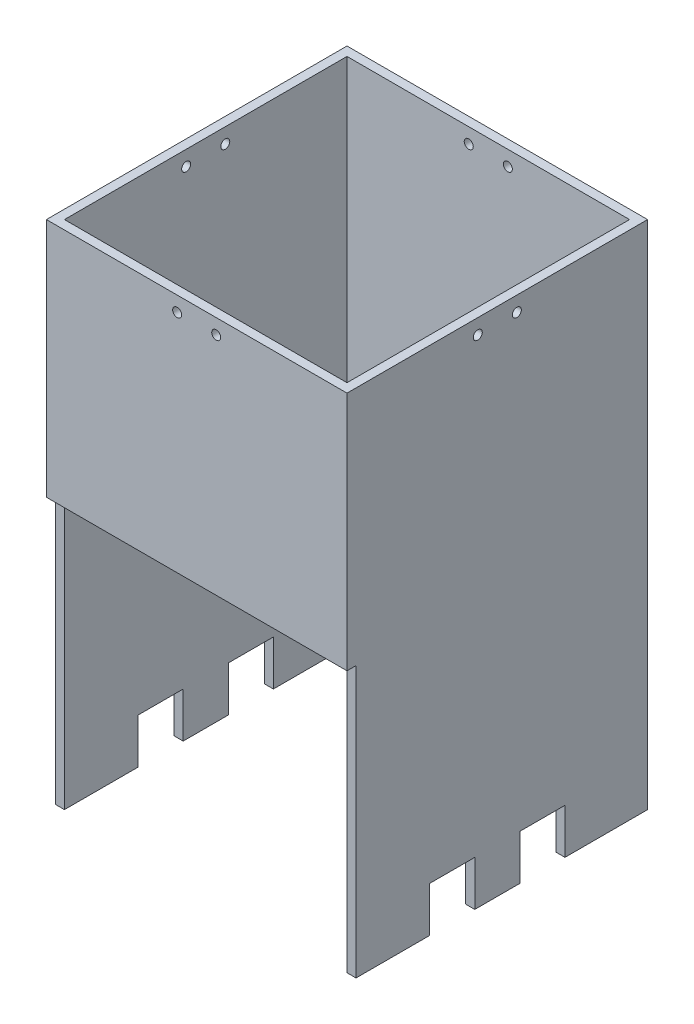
ISO-10303-21;
HEADER;
FILE_DESCRIPTION(('STEP AP214'),'2;1');
FILE_NAME('part.step','',(''),(''),'','','');
FILE_SCHEMA(('AUTOMOTIVE_DESIGN { 1 0 10303 214 1 1 1 1 }'));
ENDSEC;
DATA;
#1=APPLICATION_CONTEXT('core data for automotive mechanical design processes');
#2=APPLICATION_PROTOCOL_DEFINITION('international standard','automotive_design',2000,#1);
#3=PRODUCT_CONTEXT('',#1,'mechanical');
#4=PRODUCT('Part','Part','',(#3));
#5=PRODUCT_RELATED_PRODUCT_CATEGORY('part','',(#4));
#6=PRODUCT_DEFINITION_FORMATION('','',#4);
#7=PRODUCT_DEFINITION_CONTEXT('part definition',#1,'design');
#8=PRODUCT_DEFINITION('design','',#6,#7);
#9=PRODUCT_DEFINITION_SHAPE('','',#8);
#10=(LENGTH_UNIT() NAMED_UNIT(*) SI_UNIT(.MILLI.,.METRE.));
#11=(NAMED_UNIT(*) PLANE_ANGLE_UNIT() SI_UNIT($,.RADIAN.));
#12=(NAMED_UNIT(*) SI_UNIT($,.STERADIAN.) SOLID_ANGLE_UNIT());
#13=UNCERTAINTY_MEASURE_WITH_UNIT(LENGTH_MEASURE(1.E-05),#10,'distance_accuracy_value','');
#14=(GEOMETRIC_REPRESENTATION_CONTEXT(3) GLOBAL_UNCERTAINTY_ASSIGNED_CONTEXT((#13)) GLOBAL_UNIT_ASSIGNED_CONTEXT((#10,
#11,#12)) REPRESENTATION_CONTEXT('',''));
#15=CARTESIAN_POINT('',(0.,0.,0.));
#16=DIRECTION('',(0.,0.,1.));
#17=DIRECTION('',(1.,0.,0.));
#18=AXIS2_PLACEMENT_3D('',#15,#16,#17);
#19=CARTESIAN_POINT('',(0.,0.,0.));
#20=DIRECTION('',(0.,-1.,0.));
#21=DIRECTION('',(0.,0.,-1.));
#22=AXIS2_PLACEMENT_3D('',#19,#20,#21);
#23=PLANE('',#22);
#24=DIRECTION('',(1.,0.,0.));
#25=VECTOR('',#24,1.);
#26=CARTESIAN_POINT('',(-140.049986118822,0.,47.));
#27=LINE('',#26,#25);
#28=CARTESIAN_POINT('',(-50.,0.,47.));
#29=VERTEX_POINT('',#28);
#30=CARTESIAN_POINT('',(-47.,0.,47.));
#31=VERTEX_POINT('',#30);
#32=EDGE_CURVE('E501',#29,#31,#27,.T.);
#33=ORIENTED_EDGE('',*,*,#32,.F.);
#34=DIRECTION('',(0.,0.,1.));
#35=VECTOR('',#34,1.);
#36=CARTESIAN_POINT('',(-50.,0.,50.));
#37=LINE('',#36,#35);
#38=CARTESIAN_POINT('',(-50.,0.,22.5));
#39=VERTEX_POINT('',#38);
#40=EDGE_CURVE('E431',#39,#29,#37,.T.);
#41=ORIENTED_EDGE('',*,*,#40,.F.);
#42=DIRECTION('',(1.,0.,0.));
#43=VECTOR('',#42,1.);
#44=CARTESIAN_POINT('',(-71.2132034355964,0.,22.5));
#45=LINE('',#44,#43);
#46=CARTESIAN_POINT('',(-47.,0.,22.5));
#47=VERTEX_POINT('',#46);
#48=EDGE_CURVE('E483',#39,#47,#45,.T.);
#49=ORIENTED_EDGE('',*,*,#48,.T.);
#50=DIRECTION('',(0.,0.,1.));
#51=VECTOR('',#50,1.);
#52=CARTESIAN_POINT('',(-47.,0.,-47.));
#53=LINE('',#52,#51);
#54=EDGE_CURVE('E403',#47,#31,#53,.T.);
#55=ORIENTED_EDGE('',*,*,#54,.T.);
#56=EDGE_LOOP('',(#33,#41,#49,#55));
#57=FACE_BOUND('',#56,.T.);
#58=ADVANCED_FACE('F34',(#57),#23,.T.);
#59=DIRECTION('',(1.,0.,0.));
#60=VECTOR('',#59,1.);
#61=CARTESIAN_POINT('',(-71.2132034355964,0.,7.5));
#62=LINE('',#61,#60);
#63=CARTESIAN_POINT('',(47.,0.,7.5));
#64=VERTEX_POINT('',#63);
#65=CARTESIAN_POINT('',(50.,0.,7.5));
#66=VERTEX_POINT('',#65);
#67=EDGE_CURVE('E480',#64,#66,#62,.T.);
#68=ORIENTED_EDGE('',*,*,#67,.F.);
#69=DIRECTION('',(0.,0.,-1.));
#70=VECTOR('',#69,1.);
#71=CARTESIAN_POINT('',(47.,0.,47.));
#72=LINE('',#71,#70);
#73=CARTESIAN_POINT('',(47.,0.,-7.5));
#74=VERTEX_POINT('',#73);
#75=EDGE_CURVE('E410',#64,#74,#72,.T.);
#76=ORIENTED_EDGE('',*,*,#75,.T.);
#77=DIRECTION('',(1.,0.,0.));
#78=VECTOR('',#77,1.);
#79=CARTESIAN_POINT('',(-71.2132034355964,0.,-7.5));
#80=LINE('',#79,#78);
#81=CARTESIAN_POINT('',(50.,0.,-7.5));
#82=VERTEX_POINT('',#81);
#83=EDGE_CURVE('E342',#74,#82,#80,.T.);
#84=ORIENTED_EDGE('',*,*,#83,.T.);
#85=DIRECTION('',(0.,0.,-1.));
#86=VECTOR('',#85,1.);
#87=CARTESIAN_POINT('',(50.,0.,50.));
#88=LINE('',#87,#86);
#89=EDGE_CURVE('E430',#66,#82,#88,.T.);
#90=ORIENTED_EDGE('',*,*,#89,.F.);
#91=EDGE_LOOP('',(#68,#76,#84,#90));
#92=FACE_BOUND('',#91,.T.);
#93=ADVANCED_FACE('F536',(#92),#23,.T.);
#94=CARTESIAN_POINT('',(-50.,0.,7.5));
#95=VERTEX_POINT('',#94);
#96=CARTESIAN_POINT('',(-47.,0.,7.5));
#97=VERTEX_POINT('',#96);
#98=EDGE_CURVE('E477',#95,#97,#62,.T.);
#99=ORIENTED_EDGE('',*,*,#98,.F.);
#100=CARTESIAN_POINT('',(-50.,0.,-7.5));
#101=VERTEX_POINT('',#100);
#102=EDGE_CURVE('E436',#101,#95,#37,.T.);
#103=ORIENTED_EDGE('',*,*,#102,.F.);
#104=CARTESIAN_POINT('',(-47.,0.,-7.5));
#105=VERTEX_POINT('',#104);
#106=EDGE_CURVE('E353',#101,#105,#80,.T.);
#107=ORIENTED_EDGE('',*,*,#106,.T.);
#108=EDGE_CURVE('E408',#105,#97,#53,.T.);
#109=ORIENTED_EDGE('',*,*,#108,.T.);
#110=EDGE_LOOP('',(#99,#103,#107,#109));
#111=FACE_BOUND('',#110,.T.);
#112=ADVANCED_FACE('F475',(#111),#23,.T.);
#113=CARTESIAN_POINT('',(47.,0.,47.));
#114=VERTEX_POINT('',#113);
#115=CARTESIAN_POINT('',(50.,0.,47.));
#116=VERTEX_POINT('',#115);
#117=EDGE_CURVE('E232',#114,#116,#27,.T.);
#118=ORIENTED_EDGE('',*,*,#117,.F.);
#119=CARTESIAN_POINT('',(47.,0.,22.5));
#120=VERTEX_POINT('',#119);
#121=EDGE_CURVE('E393',#114,#120,#72,.T.);
#122=ORIENTED_EDGE('',*,*,#121,.T.);
#123=CARTESIAN_POINT('',(50.,0.,22.5));
#124=VERTEX_POINT('',#123);
#125=EDGE_CURVE('E289',#120,#124,#45,.T.);
#126=ORIENTED_EDGE('',*,*,#125,.T.);
#127=EDGE_CURVE('E428',#116,#124,#88,.T.);
#128=ORIENTED_EDGE('',*,*,#127,.F.);
#129=EDGE_LOOP('',(#118,#122,#126,#128));
#130=FACE_BOUND('',#129,.T.);
#131=ADVANCED_FACE('F513',(#130),#23,.T.);
#132=CARTESIAN_POINT('',(0.,170.,0.));
#133=DIRECTION('',(0.,-1.,0.));
#134=DIRECTION('',(0.,0.,-1.));
#135=AXIS2_PLACEMENT_3D('',#132,#133,#134);
#136=PLANE('',#135);
#137=DIRECTION('',(0.,0.,-1.));
#138=VECTOR('',#137,1.);
#139=CARTESIAN_POINT('',(50.,170.,50.));
#140=LINE('',#139,#138);
#141=CARTESIAN_POINT('',(50.,170.,50.));
#142=VERTEX_POINT('',#141);
#143=CARTESIAN_POINT('',(50.,170.,-50.));
#144=VERTEX_POINT('',#143);
#145=EDGE_CURVE('E236',#142,#144,#140,.T.);
#146=ORIENTED_EDGE('',*,*,#145,.T.);
#147=DIRECTION('',(-1.,0.,0.));
#148=VECTOR('',#147,1.);
#149=CARTESIAN_POINT('',(-50.,170.,-50.));
#150=LINE('',#149,#148);
#151=CARTESIAN_POINT('',(-50.,170.,-50.));
#152=VERTEX_POINT('',#151);
#153=EDGE_CURVE('E425',#144,#152,#150,.T.);
#154=ORIENTED_EDGE('',*,*,#153,.T.);
#155=DIRECTION('',(0.,0.,1.));
#156=VECTOR('',#155,1.);
#157=CARTESIAN_POINT('',(-50.,170.,50.));
#158=LINE('',#157,#156);
#159=CARTESIAN_POINT('',(-50.,170.,50.));
#160=VERTEX_POINT('',#159);
#161=EDGE_CURVE('E241',#152,#160,#158,.T.);
#162=ORIENTED_EDGE('',*,*,#161,.T.);
#163=DIRECTION('',(1.,0.,0.));
#164=VECTOR('',#163,1.);
#165=CARTESIAN_POINT('',(-50.,170.,50.));
#166=LINE('',#165,#164);
#167=EDGE_CURVE('E237',#160,#142,#166,.T.);
#168=ORIENTED_EDGE('',*,*,#167,.T.);
#169=EDGE_LOOP('',(#146,#154,#162,#168));
#170=FACE_BOUND('',#169,.T.);
#171=DIRECTION('',(-1.,0.,0.));
#172=VECTOR('',#171,1.);
#173=CARTESIAN_POINT('',(47.,170.,-47.));
#174=LINE('',#173,#172);
#175=CARTESIAN_POINT('',(47.,170.,-47.));
#176=VERTEX_POINT('',#175);
#177=CARTESIAN_POINT('',(-47.,170.,-47.));
#178=VERTEX_POINT('',#177);
#179=EDGE_CURVE('E390',#176,#178,#174,.T.);
#180=ORIENTED_EDGE('',*,*,#179,.F.);
#181=DIRECTION('',(0.,0.,-1.));
#182=VECTOR('',#181,1.);
#183=CARTESIAN_POINT('',(47.,170.,47.));
#184=LINE('',#183,#182);
#185=CARTESIAN_POINT('',(47.,170.,47.));
#186=VERTEX_POINT('',#185);
#187=EDGE_CURVE('E398',#186,#176,#184,.T.);
#188=ORIENTED_EDGE('',*,*,#187,.F.);
#189=DIRECTION('',(1.,0.,0.));
#190=VECTOR('',#189,1.);
#191=CARTESIAN_POINT('',(-47.,170.,47.));
#192=LINE('',#191,#190);
#193=CARTESIAN_POINT('',(-47.,170.,47.));
#194=VERTEX_POINT('',#193);
#195=EDGE_CURVE('E395',#194,#186,#192,.T.);
#196=ORIENTED_EDGE('',*,*,#195,.F.);
#197=DIRECTION('',(0.,0.,1.));
#198=VECTOR('',#197,1.);
#199=CARTESIAN_POINT('',(-47.,170.,-47.));
#200=LINE('',#199,#198);
#201=EDGE_CURVE('E392',#178,#194,#200,.T.);
#202=ORIENTED_EDGE('',*,*,#201,.F.);
#203=EDGE_LOOP('',(#180,#188,#196,#202));
#204=FACE_BOUND('',#203,.T.);
#205=ADVANCED_FACE('F525',(#170,#204),#136,.F.);
#206=DIRECTION('',(1.,0.,0.));
#207=VECTOR('',#206,1.);
#208=CARTESIAN_POINT('',(-71.2132034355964,0.,-22.5));
#209=LINE('',#208,#207);
#210=CARTESIAN_POINT('',(-50.,0.,-22.5));
#211=VERTEX_POINT('',#210);
#212=CARTESIAN_POINT('',(-47.,0.,-22.5));
#213=VERTEX_POINT('',#212);
#214=EDGE_CURVE('E350',#211,#213,#209,.T.);
#215=ORIENTED_EDGE('',*,*,#214,.F.);
#216=CARTESIAN_POINT('',(-50.,0.,-50.));
#217=VERTEX_POINT('',#216);
#218=EDGE_CURVE('E244',#217,#211,#37,.T.);
#219=ORIENTED_EDGE('',*,*,#218,.F.);
#220=DIRECTION('',(-1.,0.,0.));
#221=VECTOR('',#220,1.);
#222=CARTESIAN_POINT('',(-50.,0.,-50.));
#223=LINE('',#222,#221);
#224=CARTESIAN_POINT('',(50.,0.,-50.));
#225=VERTEX_POINT('',#224);
#226=EDGE_CURVE('E429',#225,#217,#223,.T.);
#227=ORIENTED_EDGE('',*,*,#226,.F.);
#228=CARTESIAN_POINT('',(50.,0.,-22.5));
#229=VERTEX_POINT('',#228);
#230=EDGE_CURVE('E423',#229,#225,#88,.T.);
#231=ORIENTED_EDGE('',*,*,#230,.F.);
#232=CARTESIAN_POINT('',(47.,0.,-22.5));
#233=VERTEX_POINT('',#232);
#234=EDGE_CURVE('E352',#233,#229,#209,.T.);
#235=ORIENTED_EDGE('',*,*,#234,.F.);
#236=CARTESIAN_POINT('',(47.,0.,-47.));
#237=VERTEX_POINT('',#236);
#238=EDGE_CURVE('E407',#233,#237,#72,.T.);
#239=ORIENTED_EDGE('',*,*,#238,.T.);
#240=DIRECTION('',(-1.,0.,0.));
#241=VECTOR('',#240,1.);
#242=CARTESIAN_POINT('',(47.,0.,-47.));
#243=LINE('',#242,#241);
#244=CARTESIAN_POINT('',(-47.,0.,-47.));
#245=VERTEX_POINT('',#244);
#246=EDGE_CURVE('E389',#237,#245,#243,.T.);
#247=ORIENTED_EDGE('',*,*,#246,.T.);
#248=EDGE_CURVE('E404',#245,#213,#53,.T.);
#249=ORIENTED_EDGE('',*,*,#248,.T.);
#250=EDGE_LOOP('',(#215,#219,#227,#231,#235,#239,#247,#249));
#251=FACE_BOUND('',#250,.T.);
#252=ADVANCED_FACE('F451',(#251),#23,.T.);
#253=CARTESIAN_POINT('',(50.,170.,50.));
#254=DIRECTION('',(-1.,0.,0.));
#255=DIRECTION('',(0.,0.,1.));
#256=AXIS2_PLACEMENT_3D('',#253,#254,#255);
#257=PLANE('',#256);
#258=CARTESIAN_POINT('',(50.,165.,6.49999999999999));
#259=DIRECTION('',(1.,0.,0.));
#260=DIRECTION('',(0.,0.,-1.));
#261=AXIS2_PLACEMENT_3D('',#258,#259,#260);
#262=CIRCLE('',#261,1.5);
#263=CARTESIAN_POINT('',(50.,165.,4.99999999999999));
#264=VERTEX_POINT('',#263);
#265=EDGE_CURVE('E361',#264,#264,#262,.T.);
#266=ORIENTED_EDGE('',*,*,#265,.F.);
#267=EDGE_LOOP('',(#266));
#268=FACE_BOUND('',#267,.T.);
#269=CARTESIAN_POINT('',(50.,165.,-6.50000000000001));
#270=DIRECTION('',(1.,0.,0.));
#271=DIRECTION('',(0.,0.,-1.));
#272=AXIS2_PLACEMENT_3D('',#269,#270,#271);
#273=CIRCLE('',#272,1.5);
#274=CARTESIAN_POINT('',(50.,165.,-8.00000000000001));
#275=VERTEX_POINT('',#274);
#276=EDGE_CURVE('E368',#275,#275,#273,.T.);
#277=ORIENTED_EDGE('',*,*,#276,.F.);
#278=EDGE_LOOP('',(#277));
#279=FACE_BOUND('',#278,.T.);
#280=DIRECTION('',(0.,-1.,0.));
#281=VECTOR('',#280,1.);
#282=CARTESIAN_POINT('',(50.,170.,50.));
#283=LINE('',#282,#281);
#284=CARTESIAN_POINT('',(50.,90.,50.));
#285=VERTEX_POINT('',#284);
#286=EDGE_CURVE('E228',#142,#285,#283,.T.);
#287=ORIENTED_EDGE('',*,*,#286,.T.);
#288=DIRECTION('',(0.,0.,1.));
#289=VECTOR('',#288,1.);
#290=CARTESIAN_POINT('',(50.,90.,50.));
#291=LINE('',#290,#289);
#292=CARTESIAN_POINT('',(50.,90.,47.));
#293=VERTEX_POINT('',#292);
#294=EDGE_CURVE('E211',#293,#285,#291,.T.);
#295=ORIENTED_EDGE('',*,*,#294,.F.);
#296=DIRECTION('',(0.,1.,0.));
#297=VECTOR('',#296,1.);
#298=CARTESIAN_POINT('',(50.,90.,47.));
#299=LINE('',#298,#297);
#300=EDGE_CURVE('E221',#116,#293,#299,.T.);
#301=ORIENTED_EDGE('',*,*,#300,.F.);
#302=ORIENTED_EDGE('',*,*,#127,.T.);
#303=DIRECTION('',(0.,-1.,0.));
#304=VECTOR('',#303,1.);
#305=CARTESIAN_POINT('',(50.,0.,22.5));
#306=LINE('',#305,#304);
#307=CARTESIAN_POINT('',(50.,15.,22.5));
#308=VERTEX_POINT('',#307);
#309=EDGE_CURVE('E308',#308,#124,#306,.T.);
#310=ORIENTED_EDGE('',*,*,#309,.F.);
#311=DIRECTION('',(0.,0.,1.));
#312=VECTOR('',#311,1.);
#313=CARTESIAN_POINT('',(50.,15.,7.5));
#314=LINE('',#313,#312);
#315=CARTESIAN_POINT('',(50.,15.,7.5));
#316=VERTEX_POINT('',#315);
#317=EDGE_CURVE('E310',#316,#308,#314,.T.);
#318=ORIENTED_EDGE('',*,*,#317,.F.);
#319=DIRECTION('',(0.,1.,0.));
#320=VECTOR('',#319,1.);
#321=CARTESIAN_POINT('',(50.,0.,7.5));
#322=LINE('',#321,#320);
#323=EDGE_CURVE('E306',#66,#316,#322,.T.);
#324=ORIENTED_EDGE('',*,*,#323,.F.);
#325=ORIENTED_EDGE('',*,*,#89,.T.);
#326=DIRECTION('',(0.,-1.,0.));
#327=VECTOR('',#326,1.);
#328=CARTESIAN_POINT('',(50.,0.,-7.5));
#329=LINE('',#328,#327);
#330=CARTESIAN_POINT('',(50.,15.,-7.5));
#331=VERTEX_POINT('',#330);
#332=EDGE_CURVE('E325',#331,#82,#329,.T.);
#333=ORIENTED_EDGE('',*,*,#332,.F.);
#334=DIRECTION('',(0.,0.,1.));
#335=VECTOR('',#334,1.);
#336=CARTESIAN_POINT('',(50.,15.,-7.5));
#337=LINE('',#336,#335);
#338=CARTESIAN_POINT('',(50.,15.,-22.5));
#339=VERTEX_POINT('',#338);
#340=EDGE_CURVE('E339',#339,#331,#337,.T.);
#341=ORIENTED_EDGE('',*,*,#340,.F.);
#342=DIRECTION('',(0.,1.,0.));
#343=VECTOR('',#342,1.);
#344=CARTESIAN_POINT('',(50.,0.,-22.5));
#345=LINE('',#344,#343);
#346=EDGE_CURVE('E336',#229,#339,#345,.T.);
#347=ORIENTED_EDGE('',*,*,#346,.F.);
#348=ORIENTED_EDGE('',*,*,#230,.T.);
#349=DIRECTION('',(0.,-1.,0.));
#350=VECTOR('',#349,1.);
#351=CARTESIAN_POINT('',(50.,170.,-50.));
#352=LINE('',#351,#350);
#353=EDGE_CURVE('E249',#144,#225,#352,.T.);
#354=ORIENTED_EDGE('',*,*,#353,.F.);
#355=ORIENTED_EDGE('',*,*,#145,.F.);
#356=EDGE_LOOP('',(#287,#295,#301,#302,#310,#318,#324,#325,#333,#341,#347,#348,#354,#355));
#357=FACE_BOUND('',#356,.T.);
#358=ADVANCED_FACE('F36',(#268,#279,#357),#257,.F.);
#359=CARTESIAN_POINT('',(-50.,170.,-50.));
#360=DIRECTION('',(0.,0.,1.));
#361=DIRECTION('',(1.,0.,0.));
#362=AXIS2_PLACEMENT_3D('',#359,#360,#361);
#363=PLANE('',#362);
#364=CARTESIAN_POINT('',(-6.49999999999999,165.,-50.));
#365=DIRECTION('',(0.,0.,1.));
#366=DIRECTION('',(1.,0.,0.));
#367=AXIS2_PLACEMENT_3D('',#364,#365,#366);
#368=CIRCLE('',#367,1.50000000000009);
#369=CARTESIAN_POINT('',(-4.9999999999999,165.,-50.));
#370=VERTEX_POINT('',#369);
#371=EDGE_CURVE('E262',#370,#370,#368,.F.);
#372=ORIENTED_EDGE('',*,*,#371,.F.);
#373=EDGE_LOOP('',(#372));
#374=FACE_BOUND('',#373,.T.);
#375=CARTESIAN_POINT('',(6.50000000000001,165.,-50.));
#376=DIRECTION('',(0.,0.,1.));
#377=DIRECTION('',(1.,0.,0.));
#378=AXIS2_PLACEMENT_3D('',#375,#376,#377);
#379=CIRCLE('',#378,1.50000000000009);
#380=CARTESIAN_POINT('',(8.00000000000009,165.,-50.));
#381=VERTEX_POINT('',#380);
#382=EDGE_CURVE('E257',#381,#381,#379,.F.);
#383=ORIENTED_EDGE('',*,*,#382,.F.);
#384=EDGE_LOOP('',(#383));
#385=FACE_BOUND('',#384,.T.);
#386=ORIENTED_EDGE('',*,*,#226,.T.);
#387=DIRECTION('',(0.,-1.,0.));
#388=VECTOR('',#387,1.);
#389=CARTESIAN_POINT('',(-50.,170.,-50.));
#390=LINE('',#389,#388);
#391=EDGE_CURVE('E239',#152,#217,#390,.T.);
#392=ORIENTED_EDGE('',*,*,#391,.F.);
#393=ORIENTED_EDGE('',*,*,#153,.F.);
#394=ORIENTED_EDGE('',*,*,#353,.T.);
#395=EDGE_LOOP('',(#386,#392,#393,#394));
#396=FACE_BOUND('',#395,.T.);
#397=ADVANCED_FACE('F575',(#374,#385,#396),#363,.F.);
#398=CARTESIAN_POINT('',(-50.,170.,50.));
#399=DIRECTION('',(1.,0.,0.));
#400=DIRECTION('',(0.,0.,-1.));
#401=AXIS2_PLACEMENT_3D('',#398,#399,#400);
#402=PLANE('',#401);
#403=DIRECTION('',(0.,-1.,0.));
#404=VECTOR('',#403,1.);
#405=CARTESIAN_POINT('',(-50.,90.,47.));
#406=LINE('',#405,#404);
#407=CARTESIAN_POINT('',(-50.,90.,47.));
#408=VERTEX_POINT('',#407);
#409=EDGE_CURVE('E852',#408,#29,#406,.T.);
#410=ORIENTED_EDGE('',*,*,#409,.F.);
#411=DIRECTION('',(0.,0.,-1.));
#412=VECTOR('',#411,1.);
#413=CARTESIAN_POINT('',(-50.,90.,50.));
#414=LINE('',#413,#412);
#415=CARTESIAN_POINT('',(-50.,90.,50.));
#416=VERTEX_POINT('',#415);
#417=EDGE_CURVE('E508',#416,#408,#414,.T.);
#418=ORIENTED_EDGE('',*,*,#417,.F.);
#419=DIRECTION('',(0.,-1.,0.));
#420=VECTOR('',#419,1.);
#421=CARTESIAN_POINT('',(-50.,170.,50.));
#422=LINE('',#421,#420);
#423=EDGE_CURVE('E231',#160,#416,#422,.T.);
#424=ORIENTED_EDGE('',*,*,#423,.F.);
#425=ORIENTED_EDGE('',*,*,#161,.F.);
#426=ORIENTED_EDGE('',*,*,#391,.T.);
#427=ORIENTED_EDGE('',*,*,#218,.T.);
#428=DIRECTION('',(0.,-1.,0.));
#429=VECTOR('',#428,1.);
#430=CARTESIAN_POINT('',(-50.,0.,-22.5));
#431=LINE('',#430,#429);
#432=CARTESIAN_POINT('',(-50.,15.,-22.5));
#433=VERTEX_POINT('',#432);
#434=EDGE_CURVE('E326',#433,#211,#431,.T.);
#435=ORIENTED_EDGE('',*,*,#434,.F.);
#436=DIRECTION('',(0.,0.,-1.));
#437=VECTOR('',#436,1.);
#438=CARTESIAN_POINT('',(-50.,15.,-7.5));
#439=LINE('',#438,#437);
#440=CARTESIAN_POINT('',(-50.,15.,-7.5));
#441=VERTEX_POINT('',#440);
#442=EDGE_CURVE('E328',#441,#433,#439,.T.);
#443=ORIENTED_EDGE('',*,*,#442,.F.);
#444=DIRECTION('',(0.,1.,0.));
#445=VECTOR('',#444,1.);
#446=CARTESIAN_POINT('',(-50.,0.,-7.5));
#447=LINE('',#446,#445);
#448=EDGE_CURVE('E331',#101,#441,#447,.T.);
#449=ORIENTED_EDGE('',*,*,#448,.F.);
#450=ORIENTED_EDGE('',*,*,#102,.T.);
#451=DIRECTION('',(0.,-1.,0.));
#452=VECTOR('',#451,1.);
#453=CARTESIAN_POINT('',(-50.,0.,7.5));
#454=LINE('',#453,#452);
#455=CARTESIAN_POINT('',(-50.,15.,7.5));
#456=VERTEX_POINT('',#455);
#457=EDGE_CURVE('E319',#456,#95,#454,.T.);
#458=ORIENTED_EDGE('',*,*,#457,.F.);
#459=DIRECTION('',(0.,0.,-1.));
#460=VECTOR('',#459,1.);
#461=CARTESIAN_POINT('',(-50.,15.,7.5));
#462=LINE('',#461,#460);
#463=CARTESIAN_POINT('',(-50.,15.,22.5));
#464=VERTEX_POINT('',#463);
#465=EDGE_CURVE('E316',#464,#456,#462,.T.);
#466=ORIENTED_EDGE('',*,*,#465,.F.);
#467=DIRECTION('',(0.,1.,0.));
#468=VECTOR('',#467,1.);
#469=CARTESIAN_POINT('',(-50.,0.,22.5));
#470=LINE('',#469,#468);
#471=EDGE_CURVE('E479',#39,#464,#470,.T.);
#472=ORIENTED_EDGE('',*,*,#471,.F.);
#473=ORIENTED_EDGE('',*,*,#40,.T.);
#474=EDGE_LOOP('',(#410,#418,#424,#425,#426,#427,#435,#443,#449,#450,#458,#466,#472,#473));
#475=FACE_BOUND('',#474,.T.);
#476=CARTESIAN_POINT('',(-50.,165.,6.49999999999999));
#477=DIRECTION('',(1.,0.,0.));
#478=DIRECTION('',(0.,0.,-1.));
#479=AXIS2_PLACEMENT_3D('',#476,#477,#478);
#480=CIRCLE('',#479,1.5);
#481=CARTESIAN_POINT('',(-50.,165.,4.99999999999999));
#482=VERTEX_POINT('',#481);
#483=EDGE_CURVE('E272',#482,#482,#480,.F.);
#484=ORIENTED_EDGE('',*,*,#483,.F.);
#485=EDGE_LOOP('',(#484));
#486=FACE_BOUND('',#485,.T.);
#487=CARTESIAN_POINT('',(-50.,165.,-6.50000000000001));
#488=DIRECTION('',(1.,0.,0.));
#489=DIRECTION('',(0.,0.,-1.));
#490=AXIS2_PLACEMENT_3D('',#487,#488,#489);
#491=CIRCLE('',#490,1.5);
#492=CARTESIAN_POINT('',(-50.,165.,-8.00000000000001));
#493=VERTEX_POINT('',#492);
#494=EDGE_CURVE('E267',#493,#493,#491,.F.);
#495=ORIENTED_EDGE('',*,*,#494,.F.);
#496=EDGE_LOOP('',(#495));
#497=FACE_BOUND('',#496,.T.);
#498=ADVANCED_FACE('F445',(#475,#486,#497),#402,.F.);
#499=CARTESIAN_POINT('',(-50.,170.,50.));
#500=DIRECTION('',(0.,0.,-1.));
#501=DIRECTION('',(-1.,0.,0.));
#502=AXIS2_PLACEMENT_3D('',#499,#500,#501);
#503=PLANE('',#502);
#504=CARTESIAN_POINT('',(-6.49999999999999,165.,50.));
#505=DIRECTION('',(0.,0.,1.));
#506=DIRECTION('',(1.,0.,0.));
#507=AXIS2_PLACEMENT_3D('',#504,#505,#506);
#508=CIRCLE('',#507,1.50000000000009);
#509=CARTESIAN_POINT('',(-4.9999999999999,165.,50.));
#510=VERTEX_POINT('',#509);
#511=EDGE_CURVE('E375',#510,#510,#508,.T.);
#512=ORIENTED_EDGE('',*,*,#511,.F.);
#513=EDGE_LOOP('',(#512));
#514=FACE_BOUND('',#513,.T.);
#515=CARTESIAN_POINT('',(6.50000000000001,165.,50.));
#516=DIRECTION('',(0.,0.,1.));
#517=DIRECTION('',(1.,0.,0.));
#518=AXIS2_PLACEMENT_3D('',#515,#516,#517);
#519=CIRCLE('',#518,1.50000000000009);
#520=CARTESIAN_POINT('',(8.00000000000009,165.,50.));
#521=VERTEX_POINT('',#520);
#522=EDGE_CURVE('E382',#521,#521,#519,.T.);
#523=ORIENTED_EDGE('',*,*,#522,.F.);
#524=EDGE_LOOP('',(#523));
#525=FACE_BOUND('',#524,.T.);
#526=ORIENTED_EDGE('',*,*,#423,.T.);
#527=DIRECTION('',(1.,0.,0.));
#528=VECTOR('',#527,1.);
#529=CARTESIAN_POINT('',(-140.049986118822,90.,50.));
#530=LINE('',#529,#528);
#531=EDGE_CURVE('E214',#416,#285,#530,.T.);
#532=ORIENTED_EDGE('',*,*,#531,.T.);
#533=ORIENTED_EDGE('',*,*,#286,.F.);
#534=ORIENTED_EDGE('',*,*,#167,.F.);
#535=EDGE_LOOP('',(#526,#532,#533,#534));
#536=FACE_BOUND('',#535,.T.);
#537=ADVANCED_FACE('F226',(#514,#525,#536),#503,.F.);
#538=CARTESIAN_POINT('',(47.,170.,-47.));
#539=DIRECTION('',(0.,0.,1.));
#540=DIRECTION('',(1.,0.,0.));
#541=AXIS2_PLACEMENT_3D('',#538,#539,#540);
#542=PLANE('',#541);
#543=CARTESIAN_POINT('',(-6.49999999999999,165.,-47.));
#544=DIRECTION('',(0.,0.,1.));
#545=DIRECTION('',(1.,0.,0.));
#546=AXIS2_PLACEMENT_3D('',#543,#544,#545);
#547=CIRCLE('',#546,1.50000000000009);
#548=CARTESIAN_POINT('',(-4.9999999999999,165.,-47.));
#549=VERTEX_POINT('',#548);
#550=EDGE_CURVE('E261',#549,#549,#547,.T.);
#551=ORIENTED_EDGE('',*,*,#550,.F.);
#552=EDGE_LOOP('',(#551));
#553=FACE_BOUND('',#552,.T.);
#554=CARTESIAN_POINT('',(6.50000000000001,165.,-47.));
#555=DIRECTION('',(0.,0.,1.));
#556=DIRECTION('',(1.,0.,0.));
#557=AXIS2_PLACEMENT_3D('',#554,#555,#556);
#558=CIRCLE('',#557,1.50000000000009);
#559=CARTESIAN_POINT('',(8.00000000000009,165.,-47.));
#560=VERTEX_POINT('',#559);
#561=EDGE_CURVE('E256',#560,#560,#558,.T.);
#562=ORIENTED_EDGE('',*,*,#561,.F.);
#563=EDGE_LOOP('',(#562));
#564=FACE_BOUND('',#563,.T.);
#565=ORIENTED_EDGE('',*,*,#246,.F.);
#566=DIRECTION('',(0.,-1.,0.));
#567=VECTOR('',#566,1.);
#568=CARTESIAN_POINT('',(47.,170.,-47.));
#569=LINE('',#568,#567);
#570=EDGE_CURVE('E400',#176,#237,#569,.T.);
#571=ORIENTED_EDGE('',*,*,#570,.F.);
#572=ORIENTED_EDGE('',*,*,#179,.T.);
#573=DIRECTION('',(0.,-1.,0.));
#574=VECTOR('',#573,1.);
#575=CARTESIAN_POINT('',(-47.,170.,-47.));
#576=LINE('',#575,#574);
#577=EDGE_CURVE('E420',#178,#245,#576,.T.);
#578=ORIENTED_EDGE('',*,*,#577,.T.);
#579=EDGE_LOOP('',(#565,#571,#572,#578));
#580=FACE_BOUND('',#579,.T.);
#581=ADVANCED_FACE('F530',(#553,#564,#580),#542,.T.);
#582=CARTESIAN_POINT('',(-47.,170.,-47.));
#583=DIRECTION('',(1.,0.,0.));
#584=DIRECTION('',(0.,0.,-1.));
#585=AXIS2_PLACEMENT_3D('',#582,#583,#584);
#586=PLANE('',#585);
#587=DIRECTION('',(0.,1.,0.));
#588=VECTOR('',#587,1.);
#589=CARTESIAN_POINT('',(-47.,170.,7.5));
#590=LINE('',#589,#588);
#591=CARTESIAN_POINT('',(-47.,15.,7.5));
#592=VERTEX_POINT('',#591);
#593=EDGE_CURVE('E323',#97,#592,#590,.T.);
#594=ORIENTED_EDGE('',*,*,#593,.F.);
#595=ORIENTED_EDGE('',*,*,#108,.F.);
#596=DIRECTION('',(0.,-1.,0.));
#597=VECTOR('',#596,1.);
#598=CARTESIAN_POINT('',(-47.,170.,-7.5));
#599=LINE('',#598,#597);
#600=CARTESIAN_POINT('',(-47.,15.,-7.5));
#601=VERTEX_POINT('',#600);
#602=EDGE_CURVE('E359',#601,#105,#599,.T.);
#603=ORIENTED_EDGE('',*,*,#602,.F.);
#604=DIRECTION('',(0.,0.,1.));
#605=VECTOR('',#604,1.);
#606=CARTESIAN_POINT('',(-47.,15.,-47.));
#607=LINE('',#606,#605);
#608=CARTESIAN_POINT('',(-47.,15.,-22.5));
#609=VERTEX_POINT('',#608);
#610=EDGE_CURVE('E357',#609,#601,#607,.T.);
#611=ORIENTED_EDGE('',*,*,#610,.F.);
#612=DIRECTION('',(0.,1.,0.));
#613=VECTOR('',#612,1.);
#614=CARTESIAN_POINT('',(-47.,170.,-22.5));
#615=LINE('',#614,#613);
#616=EDGE_CURVE('E333',#213,#609,#615,.T.);
#617=ORIENTED_EDGE('',*,*,#616,.F.);
#618=ORIENTED_EDGE('',*,*,#248,.F.);
#619=ORIENTED_EDGE('',*,*,#577,.F.);
#620=ORIENTED_EDGE('',*,*,#201,.T.);
#621=DIRECTION('',(0.,-1.,0.));
#622=VECTOR('',#621,1.);
#623=CARTESIAN_POINT('',(-47.,170.,47.));
#624=LINE('',#623,#622);
#625=CARTESIAN_POINT('',(-47.,90.,47.));
#626=VERTEX_POINT('',#625);
#627=EDGE_CURVE('E417',#194,#626,#624,.T.);
#628=ORIENTED_EDGE('',*,*,#627,.T.);
#629=DIRECTION('',(0.,1.,0.));
#630=VECTOR('',#629,1.);
#631=CARTESIAN_POINT('',(-47.,170.,47.));
#632=LINE('',#631,#630);
#633=EDGE_CURVE('E499',#31,#626,#632,.T.);
#634=ORIENTED_EDGE('',*,*,#633,.F.);
#635=ORIENTED_EDGE('',*,*,#54,.F.);
#636=DIRECTION('',(0.,-1.,0.));
#637=VECTOR('',#636,1.);
#638=CARTESIAN_POINT('',(-47.,170.,22.5));
#639=LINE('',#638,#637);
#640=CARTESIAN_POINT('',(-47.,15.,22.5));
#641=VERTEX_POINT('',#640);
#642=EDGE_CURVE('E321',#641,#47,#639,.T.);
#643=ORIENTED_EDGE('',*,*,#642,.F.);
#644=DIRECTION('',(0.,0.,1.));
#645=VECTOR('',#644,1.);
#646=CARTESIAN_POINT('',(-47.,15.,-47.));
#647=LINE('',#646,#645);
#648=EDGE_CURVE('E318',#592,#641,#647,.T.);
#649=ORIENTED_EDGE('',*,*,#648,.F.);
#650=EDGE_LOOP('',(#594,#595,#603,#611,#617,#618,#619,#620,#628,#634,#635,#643,#649));
#651=FACE_BOUND('',#650,.T.);
#652=CARTESIAN_POINT('',(-47.,165.,6.49999999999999));
#653=DIRECTION('',(1.,0.,0.));
#654=DIRECTION('',(0.,0.,-1.));
#655=AXIS2_PLACEMENT_3D('',#652,#653,#654);
#656=CIRCLE('',#655,1.5);
#657=CARTESIAN_POINT('',(-47.,165.,4.99999999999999));
#658=VERTEX_POINT('',#657);
#659=EDGE_CURVE('E271',#658,#658,#656,.T.);
#660=ORIENTED_EDGE('',*,*,#659,.F.);
#661=EDGE_LOOP('',(#660));
#662=FACE_BOUND('',#661,.T.);
#663=CARTESIAN_POINT('',(-47.,165.,-6.50000000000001));
#664=DIRECTION('',(1.,0.,0.));
#665=DIRECTION('',(0.,0.,-1.));
#666=AXIS2_PLACEMENT_3D('',#663,#664,#665);
#667=CIRCLE('',#666,1.5);
#668=CARTESIAN_POINT('',(-47.,165.,-8.00000000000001));
#669=VERTEX_POINT('',#668);
#670=EDGE_CURVE('E266',#669,#669,#667,.T.);
#671=ORIENTED_EDGE('',*,*,#670,.F.);
#672=EDGE_LOOP('',(#671));
#673=FACE_BOUND('',#672,.T.);
#674=ADVANCED_FACE('F460',(#651,#662,#673),#586,.T.);
#675=CARTESIAN_POINT('',(-47.,170.,47.));
#676=DIRECTION('',(0.,0.,-1.));
#677=DIRECTION('',(-1.,0.,0.));
#678=AXIS2_PLACEMENT_3D('',#675,#676,#677);
#679=PLANE('',#678);
#680=DIRECTION('',(1.,0.,0.));
#681=VECTOR('',#680,1.);
#682=CARTESIAN_POINT('',(-140.049986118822,90.,47.));
#683=LINE('',#682,#681);
#684=CARTESIAN_POINT('',(47.,90.,47.));
#685=VERTEX_POINT('',#684);
#686=EDGE_CURVE('E49',#626,#685,#683,.T.);
#687=ORIENTED_EDGE('',*,*,#686,.F.);
#688=ORIENTED_EDGE('',*,*,#627,.F.);
#689=ORIENTED_EDGE('',*,*,#195,.T.);
#690=DIRECTION('',(0.,-1.,0.));
#691=VECTOR('',#690,1.);
#692=CARTESIAN_POINT('',(47.,170.,47.));
#693=LINE('',#692,#691);
#694=EDGE_CURVE('E414',#186,#685,#693,.T.);
#695=ORIENTED_EDGE('',*,*,#694,.T.);
#696=EDGE_LOOP('',(#687,#688,#689,#695));
#697=FACE_BOUND('',#696,.T.);
#698=CARTESIAN_POINT('',(-6.49999999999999,165.,47.));
#699=DIRECTION('',(0.,0.,-1.));
#700=DIRECTION('',(-1.,0.,0.));
#701=AXIS2_PLACEMENT_3D('',#698,#699,#700);
#702=CIRCLE('',#701,1.50000000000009);
#703=CARTESIAN_POINT('',(-8.00000000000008,165.,47.));
#704=VERTEX_POINT('',#703);
#705=EDGE_CURVE('E258',#704,#704,#702,.T.);
#706=ORIENTED_EDGE('',*,*,#705,.F.);
#707=EDGE_LOOP('',(#706));
#708=FACE_BOUND('',#707,.T.);
#709=CARTESIAN_POINT('',(6.50000000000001,165.,47.));
#710=DIRECTION('',(0.,0.,-1.));
#711=DIRECTION('',(-1.,0.,0.));
#712=AXIS2_PLACEMENT_3D('',#709,#710,#711);
#713=CIRCLE('',#712,1.50000000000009);
#714=CARTESIAN_POINT('',(4.99999999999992,165.,47.));
#715=VERTEX_POINT('',#714);
#716=EDGE_CURVE('E253',#715,#715,#713,.T.);
#717=ORIENTED_EDGE('',*,*,#716,.F.);
#718=EDGE_LOOP('',(#717));
#719=FACE_BOUND('',#718,.T.);
#720=ADVANCED_FACE('F517',(#697,#708,#719),#679,.T.);
#721=CARTESIAN_POINT('',(47.,170.,47.));
#722=DIRECTION('',(-1.,0.,0.));
#723=DIRECTION('',(0.,0.,1.));
#724=AXIS2_PLACEMENT_3D('',#721,#722,#723);
#725=PLANE('',#724);
#726=DIRECTION('',(0.,-1.,0.));
#727=VECTOR('',#726,1.);
#728=CARTESIAN_POINT('',(47.,170.,7.49999999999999));
#729=LINE('',#728,#727);
#730=CARTESIAN_POINT('',(47.,15.,7.5));
#731=VERTEX_POINT('',#730);
#732=EDGE_CURVE('E11',#731,#64,#729,.T.);
#733=ORIENTED_EDGE('',*,*,#732,.F.);
#734=DIRECTION('',(0.,0.,-1.));
#735=VECTOR('',#734,1.);
#736=CARTESIAN_POINT('',(47.,15.,47.));
#737=LINE('',#736,#735);
#738=CARTESIAN_POINT('',(47.,15.,22.5));
#739=VERTEX_POINT('',#738);
#740=EDGE_CURVE('E279',#739,#731,#737,.T.);
#741=ORIENTED_EDGE('',*,*,#740,.F.);
#742=DIRECTION('',(0.,1.,0.));
#743=VECTOR('',#742,1.);
#744=CARTESIAN_POINT('',(47.,170.,22.5));
#745=LINE('',#744,#743);
#746=EDGE_CURVE('E42',#120,#739,#745,.T.);
#747=ORIENTED_EDGE('',*,*,#746,.F.);
#748=ORIENTED_EDGE('',*,*,#121,.F.);
#749=EDGE_CURVE('E413',#685,#114,#693,.T.);
#750=ORIENTED_EDGE('',*,*,#749,.F.);
#751=ORIENTED_EDGE('',*,*,#694,.F.);
#752=ORIENTED_EDGE('',*,*,#187,.T.);
#753=ORIENTED_EDGE('',*,*,#570,.T.);
#754=ORIENTED_EDGE('',*,*,#238,.F.);
#755=DIRECTION('',(0.,-1.,0.));
#756=VECTOR('',#755,1.);
#757=CARTESIAN_POINT('',(47.,170.,-22.5));
#758=LINE('',#757,#756);
#759=CARTESIAN_POINT('',(47.,15.,-22.5));
#760=VERTEX_POINT('',#759);
#761=EDGE_CURVE('E252',#760,#233,#758,.T.);
#762=ORIENTED_EDGE('',*,*,#761,.F.);
#763=DIRECTION('',(0.,0.,-1.));
#764=VECTOR('',#763,1.);
#765=CARTESIAN_POINT('',(47.,15.,47.));
#766=LINE('',#765,#764);
#767=CARTESIAN_POINT('',(47.,15.,-7.5));
#768=VERTEX_POINT('',#767);
#769=EDGE_CURVE('E274',#768,#760,#766,.T.);
#770=ORIENTED_EDGE('',*,*,#769,.F.);
#771=DIRECTION('',(0.,1.,0.));
#772=VECTOR('',#771,1.);
#773=CARTESIAN_POINT('',(47.,170.,-7.50000000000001));
#774=LINE('',#773,#772);
#775=EDGE_CURVE('E277',#74,#768,#774,.T.);
#776=ORIENTED_EDGE('',*,*,#775,.F.);
#777=ORIENTED_EDGE('',*,*,#75,.F.);
#778=EDGE_LOOP('',(#733,#741,#747,#748,#750,#751,#752,#753,#754,#762,#770,#776,#777));
#779=FACE_BOUND('',#778,.T.);
#780=CARTESIAN_POINT('',(47.,165.,6.49999999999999));
#781=DIRECTION('',(-1.,0.,0.));
#782=DIRECTION('',(0.,0.,1.));
#783=AXIS2_PLACEMENT_3D('',#780,#781,#782);
#784=CIRCLE('',#783,1.5);
#785=CARTESIAN_POINT('',(47.,165.,7.99999999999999));
#786=VERTEX_POINT('',#785);
#787=EDGE_CURVE('E268',#786,#786,#784,.T.);
#788=ORIENTED_EDGE('',*,*,#787,.F.);
#789=EDGE_LOOP('',(#788));
#790=FACE_BOUND('',#789,.T.);
#791=CARTESIAN_POINT('',(47.,165.,-6.50000000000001));
#792=DIRECTION('',(-1.,0.,0.));
#793=DIRECTION('',(0.,0.,1.));
#794=AXIS2_PLACEMENT_3D('',#791,#792,#793);
#795=CIRCLE('',#794,1.5);
#796=CARTESIAN_POINT('',(47.,165.,-5.));
#797=VERTEX_POINT('',#796);
#798=EDGE_CURVE('E263',#797,#797,#795,.T.);
#799=ORIENTED_EDGE('',*,*,#798,.F.);
#800=EDGE_LOOP('',(#799));
#801=FACE_BOUND('',#800,.T.);
#802=ADVANCED_FACE('F294',(#779,#790,#801),#725,.T.);
#803=CARTESIAN_POINT('',(6.50000000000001,165.,-54.2426406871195));
#804=DIRECTION('',(0.,0.,1.));
#805=DIRECTION('',(1.,0.,0.));
#806=AXIS2_PLACEMENT_3D('',#803,#804,#805);
#807=CYLINDRICAL_SURFACE('',#806,1.50000000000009);
#808=ORIENTED_EDGE('',*,*,#716,.T.);
#809=EDGE_LOOP('',(#808));
#810=FACE_BOUND('',#809,.T.);
#811=ORIENTED_EDGE('',*,*,#522,.T.);
#812=EDGE_LOOP('',(#811));
#813=FACE_BOUND('',#812,.T.);
#814=ADVANCED_FACE('F652',(#810,#813),#807,.F.);
#815=ORIENTED_EDGE('',*,*,#561,.T.);
#816=EDGE_LOOP('',(#815));
#817=FACE_BOUND('',#816,.T.);
#818=ORIENTED_EDGE('',*,*,#382,.T.);
#819=EDGE_LOOP('',(#818));
#820=FACE_BOUND('',#819,.T.);
#821=ADVANCED_FACE('F643',(#817,#820),#807,.F.);
#822=CARTESIAN_POINT('',(-6.49999999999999,165.,-54.2426406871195));
#823=DIRECTION('',(0.,0.,1.));
#824=DIRECTION('',(1.,0.,0.));
#825=AXIS2_PLACEMENT_3D('',#822,#823,#824);
#826=CYLINDRICAL_SURFACE('',#825,1.50000000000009);
#827=ORIENTED_EDGE('',*,*,#705,.T.);
#828=EDGE_LOOP('',(#827));
#829=FACE_BOUND('',#828,.T.);
#830=ORIENTED_EDGE('',*,*,#511,.T.);
#831=EDGE_LOOP('',(#830));
#832=FACE_BOUND('',#831,.T.);
#833=ADVANCED_FACE('F633',(#829,#832),#826,.F.);
#834=ORIENTED_EDGE('',*,*,#550,.T.);
#835=EDGE_LOOP('',(#834));
#836=FACE_BOUND('',#835,.T.);
#837=ORIENTED_EDGE('',*,*,#371,.T.);
#838=EDGE_LOOP('',(#837));
#839=FACE_BOUND('',#838,.T.);
#840=ADVANCED_FACE('F624',(#836,#839),#826,.F.);
#841=CARTESIAN_POINT('',(-54.2426406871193,165.,-6.50000000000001));
#842=DIRECTION('',(1.,0.,0.));
#843=DIRECTION('',(0.,0.,-1.));
#844=AXIS2_PLACEMENT_3D('',#841,#842,#843);
#845=CYLINDRICAL_SURFACE('',#844,1.5);
#846=ORIENTED_EDGE('',*,*,#798,.T.);
#847=EDGE_LOOP('',(#846));
#848=FACE_BOUND('',#847,.T.);
#849=ORIENTED_EDGE('',*,*,#276,.T.);
#850=EDGE_LOOP('',(#849));
#851=FACE_BOUND('',#850,.T.);
#852=ADVANCED_FACE('F614',(#848,#851),#845,.F.);
#853=ORIENTED_EDGE('',*,*,#670,.T.);
#854=EDGE_LOOP('',(#853));
#855=FACE_BOUND('',#854,.T.);
#856=ORIENTED_EDGE('',*,*,#494,.T.);
#857=EDGE_LOOP('',(#856));
#858=FACE_BOUND('',#857,.T.);
#859=ADVANCED_FACE('F605',(#855,#858),#845,.F.);
#860=CARTESIAN_POINT('',(-54.2426406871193,165.,6.49999999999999));
#861=DIRECTION('',(1.,0.,0.));
#862=DIRECTION('',(0.,0.,-1.));
#863=AXIS2_PLACEMENT_3D('',#860,#861,#862);
#864=CYLINDRICAL_SURFACE('',#863,1.5);
#865=ORIENTED_EDGE('',*,*,#787,.T.);
#866=EDGE_LOOP('',(#865));
#867=FACE_BOUND('',#866,.T.);
#868=ORIENTED_EDGE('',*,*,#265,.T.);
#869=EDGE_LOOP('',(#868));
#870=FACE_BOUND('',#869,.T.);
#871=ADVANCED_FACE('F558',(#867,#870),#864,.F.);
#872=ORIENTED_EDGE('',*,*,#659,.T.);
#873=EDGE_LOOP('',(#872));
#874=FACE_BOUND('',#873,.T.);
#875=ORIENTED_EDGE('',*,*,#483,.T.);
#876=EDGE_LOOP('',(#875));
#877=FACE_BOUND('',#876,.T.);
#878=ADVANCED_FACE('F551',(#874,#877),#864,.F.);
#879=CARTESIAN_POINT('',(-71.2132034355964,0.,-22.5));
#880=DIRECTION('',(0.,0.,-1.));
#881=DIRECTION('',(-1.,0.,0.));
#882=AXIS2_PLACEMENT_3D('',#879,#880,#881);
#883=PLANE('',#882);
#884=ORIENTED_EDGE('',*,*,#761,.T.);
#885=ORIENTED_EDGE('',*,*,#234,.T.);
#886=ORIENTED_EDGE('',*,*,#346,.T.);
#887=DIRECTION('',(1.,0.,0.));
#888=VECTOR('',#887,1.);
#889=CARTESIAN_POINT('',(-71.2132034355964,15.,-22.5));
#890=LINE('',#889,#888);
#891=EDGE_CURVE('E349',#760,#339,#890,.T.);
#892=ORIENTED_EDGE('',*,*,#891,.F.);
#893=EDGE_LOOP('',(#884,#885,#886,#892));
#894=FACE_BOUND('',#893,.T.);
#895=ADVANCED_FACE('F549',(#894),#883,.F.);
#896=CARTESIAN_POINT('',(-71.2132034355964,15.,-7.5));
#897=DIRECTION('',(0.,1.,0.));
#898=DIRECTION('',(0.,0.,1.));
#899=AXIS2_PLACEMENT_3D('',#896,#897,#898);
#900=PLANE('',#899);
#901=ORIENTED_EDGE('',*,*,#769,.T.);
#902=ORIENTED_EDGE('',*,*,#891,.T.);
#903=ORIENTED_EDGE('',*,*,#340,.T.);
#904=DIRECTION('',(1.,0.,0.));
#905=VECTOR('',#904,1.);
#906=CARTESIAN_POINT('',(-71.2132034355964,15.,-7.5));
#907=LINE('',#906,#905);
#908=EDGE_CURVE('E345',#768,#331,#907,.T.);
#909=ORIENTED_EDGE('',*,*,#908,.F.);
#910=EDGE_LOOP('',(#901,#902,#903,#909));
#911=FACE_BOUND('',#910,.T.);
#912=ADVANCED_FACE('F545',(#911),#900,.F.);
#913=CARTESIAN_POINT('',(-71.2132034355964,0.,-7.5));
#914=DIRECTION('',(0.,0.,1.));
#915=DIRECTION('',(1.,0.,0.));
#916=AXIS2_PLACEMENT_3D('',#913,#914,#915);
#917=PLANE('',#916);
#918=ORIENTED_EDGE('',*,*,#775,.T.);
#919=ORIENTED_EDGE('',*,*,#908,.T.);
#920=ORIENTED_EDGE('',*,*,#332,.T.);
#921=ORIENTED_EDGE('',*,*,#83,.F.);
#922=EDGE_LOOP('',(#918,#919,#920,#921));
#923=FACE_BOUND('',#922,.T.);
#924=ADVANCED_FACE('F540',(#923),#917,.F.);
#925=ORIENTED_EDGE('',*,*,#602,.T.);
#926=ORIENTED_EDGE('',*,*,#106,.F.);
#927=ORIENTED_EDGE('',*,*,#448,.T.);
#928=EDGE_CURVE('E329',#441,#601,#907,.T.);
#929=ORIENTED_EDGE('',*,*,#928,.T.);
#930=EDGE_LOOP('',(#925,#926,#927,#929));
#931=FACE_BOUND('',#930,.T.);
#932=ADVANCED_FACE('F469',(#931),#917,.F.);
#933=ORIENTED_EDGE('',*,*,#610,.T.);
#934=ORIENTED_EDGE('',*,*,#928,.F.);
#935=ORIENTED_EDGE('',*,*,#442,.T.);
#936=EDGE_CURVE('E346',#433,#609,#890,.T.);
#937=ORIENTED_EDGE('',*,*,#936,.T.);
#938=EDGE_LOOP('',(#933,#934,#935,#937));
#939=FACE_BOUND('',#938,.T.);
#940=ADVANCED_FACE('F467',(#939),#900,.F.);
#941=ORIENTED_EDGE('',*,*,#616,.T.);
#942=ORIENTED_EDGE('',*,*,#936,.F.);
#943=ORIENTED_EDGE('',*,*,#434,.T.);
#944=ORIENTED_EDGE('',*,*,#214,.T.);
#945=EDGE_LOOP('',(#941,#942,#943,#944));
#946=FACE_BOUND('',#945,.T.);
#947=ADVANCED_FACE('F455',(#946),#883,.F.);
#948=CARTESIAN_POINT('',(-71.2132034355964,15.,7.5));
#949=DIRECTION('',(0.,1.,0.));
#950=DIRECTION('',(0.,0.,1.));
#951=AXIS2_PLACEMENT_3D('',#948,#949,#950);
#952=PLANE('',#951);
#953=ORIENTED_EDGE('',*,*,#740,.T.);
#954=DIRECTION('',(1.,0.,0.));
#955=VECTOR('',#954,1.);
#956=CARTESIAN_POINT('',(-71.2132034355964,15.,7.5));
#957=LINE('',#956,#955);
#958=EDGE_CURVE('E300',#731,#316,#957,.T.);
#959=ORIENTED_EDGE('',*,*,#958,.T.);
#960=ORIENTED_EDGE('',*,*,#317,.T.);
#961=DIRECTION('',(1.,0.,0.));
#962=VECTOR('',#961,1.);
#963=CARTESIAN_POINT('',(-71.2132034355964,15.,22.5));
#964=LINE('',#963,#962);
#965=EDGE_CURVE('E286',#739,#308,#964,.T.);
#966=ORIENTED_EDGE('',*,*,#965,.F.);
#967=EDGE_LOOP('',(#953,#959,#960,#966));
#968=FACE_BOUND('',#967,.T.);
#969=ADVANCED_FACE('F299',(#968),#952,.F.);
#970=CARTESIAN_POINT('',(-71.2132034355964,0.,22.5));
#971=DIRECTION('',(0.,0.,1.));
#972=DIRECTION('',(1.,0.,0.));
#973=AXIS2_PLACEMENT_3D('',#970,#971,#972);
#974=PLANE('',#973);
#975=ORIENTED_EDGE('',*,*,#746,.T.);
#976=ORIENTED_EDGE('',*,*,#965,.T.);
#977=ORIENTED_EDGE('',*,*,#309,.T.);
#978=ORIENTED_EDGE('',*,*,#125,.F.);
#979=EDGE_LOOP('',(#975,#976,#977,#978));
#980=FACE_BOUND('',#979,.T.);
#981=ADVANCED_FACE('F284',(#980),#974,.F.);
#982=CARTESIAN_POINT('',(-71.2132034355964,0.,7.5));
#983=DIRECTION('',(0.,0.,-1.));
#984=DIRECTION('',(-1.,0.,0.));
#985=AXIS2_PLACEMENT_3D('',#982,#983,#984);
#986=PLANE('',#985);
#987=ORIENTED_EDGE('',*,*,#732,.T.);
#988=ORIENTED_EDGE('',*,*,#67,.T.);
#989=ORIENTED_EDGE('',*,*,#323,.T.);
#990=ORIENTED_EDGE('',*,*,#958,.F.);
#991=EDGE_LOOP('',(#987,#988,#989,#990));
#992=FACE_BOUND('',#991,.T.);
#993=ADVANCED_FACE('F303',(#992),#986,.F.);
#994=ORIENTED_EDGE('',*,*,#593,.T.);
#995=EDGE_CURVE('E57',#456,#592,#957,.T.);
#996=ORIENTED_EDGE('',*,*,#995,.F.);
#997=ORIENTED_EDGE('',*,*,#457,.T.);
#998=ORIENTED_EDGE('',*,*,#98,.T.);
#999=EDGE_LOOP('',(#994,#996,#997,#998));
#1000=FACE_BOUND('',#999,.T.);
#1001=ADVANCED_FACE('F773',(#1000),#986,.F.);
#1002=ORIENTED_EDGE('',*,*,#642,.T.);
#1003=ORIENTED_EDGE('',*,*,#48,.F.);
#1004=ORIENTED_EDGE('',*,*,#471,.T.);
#1005=EDGE_CURVE('E314',#464,#641,#964,.T.);
#1006=ORIENTED_EDGE('',*,*,#1005,.T.);
#1007=EDGE_LOOP('',(#1002,#1003,#1004,#1006));
#1008=FACE_BOUND('',#1007,.T.);
#1009=ADVANCED_FACE('F495',(#1008),#974,.F.);
#1010=ORIENTED_EDGE('',*,*,#648,.T.);
#1011=ORIENTED_EDGE('',*,*,#1005,.F.);
#1012=ORIENTED_EDGE('',*,*,#465,.T.);
#1013=ORIENTED_EDGE('',*,*,#995,.T.);
#1014=EDGE_LOOP('',(#1010,#1011,#1012,#1013));
#1015=FACE_BOUND('',#1014,.T.);
#1016=ADVANCED_FACE('F745',(#1015),#952,.F.);
#1017=CARTESIAN_POINT('',(-140.049986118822,90.,47.));
#1018=DIRECTION('',(0.,0.,-1.));
#1019=DIRECTION('',(-1.,0.,0.));
#1020=AXIS2_PLACEMENT_3D('',#1017,#1018,#1019);
#1021=PLANE('',#1020);
#1022=ORIENTED_EDGE('',*,*,#633,.T.);
#1023=EDGE_CURVE('E505',#408,#626,#683,.T.);
#1024=ORIENTED_EDGE('',*,*,#1023,.F.);
#1025=ORIENTED_EDGE('',*,*,#409,.T.);
#1026=ORIENTED_EDGE('',*,*,#32,.T.);
#1027=EDGE_LOOP('',(#1022,#1024,#1025,#1026));
#1028=FACE_BOUND('',#1027,.T.);
#1029=ADVANCED_FACE('F740',(#1028),#1021,.F.);
#1030=CARTESIAN_POINT('',(-140.049986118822,90.,50.));
#1031=DIRECTION('',(0.,1.,0.));
#1032=DIRECTION('',(0.,0.,1.));
#1033=AXIS2_PLACEMENT_3D('',#1030,#1031,#1032);
#1034=PLANE('',#1033);
#1035=ORIENTED_EDGE('',*,*,#417,.T.);
#1036=ORIENTED_EDGE('',*,*,#1023,.T.);
#1037=ORIENTED_EDGE('',*,*,#686,.T.);
#1038=EDGE_CURVE('E216',#685,#293,#683,.T.);
#1039=ORIENTED_EDGE('',*,*,#1038,.T.);
#1040=ORIENTED_EDGE('',*,*,#294,.T.);
#1041=ORIENTED_EDGE('',*,*,#531,.F.);
#1042=EDGE_LOOP('',(#1035,#1036,#1037,#1039,#1040,#1041));
#1043=FACE_BOUND('',#1042,.T.);
#1044=ADVANCED_FACE('F213',(#1043),#1034,.F.);
#1045=ORIENTED_EDGE('',*,*,#749,.T.);
#1046=ORIENTED_EDGE('',*,*,#117,.T.);
#1047=ORIENTED_EDGE('',*,*,#300,.T.);
#1048=ORIENTED_EDGE('',*,*,#1038,.F.);
#1049=EDGE_LOOP('',(#1045,#1046,#1047,#1048));
#1050=FACE_BOUND('',#1049,.T.);
#1051=ADVANCED_FACE('F747',(#1050),#1021,.F.);
#1052=CLOSED_SHELL('',(#58,#93,#112,#131,#205,#252,#358,#397,#498,#537,#581,#674,#720,#802,#814,
#821,#833,#840,#852,#859,#871,#878,#895,#912,#924,#932,#940,#947,#969,#981,#993,#1001,#1009,
#1016,#1029,#1044,#1051));
#1053=MANIFOLD_SOLID_BREP('B2',#1052);
#1054=ADVANCED_BREP_SHAPE_REPRESENTATION('',(#18,#1053),#14);
#1055=SHAPE_DEFINITION_REPRESENTATION(#9,#1054);
ENDSEC;
END-ISO-10303-21;
